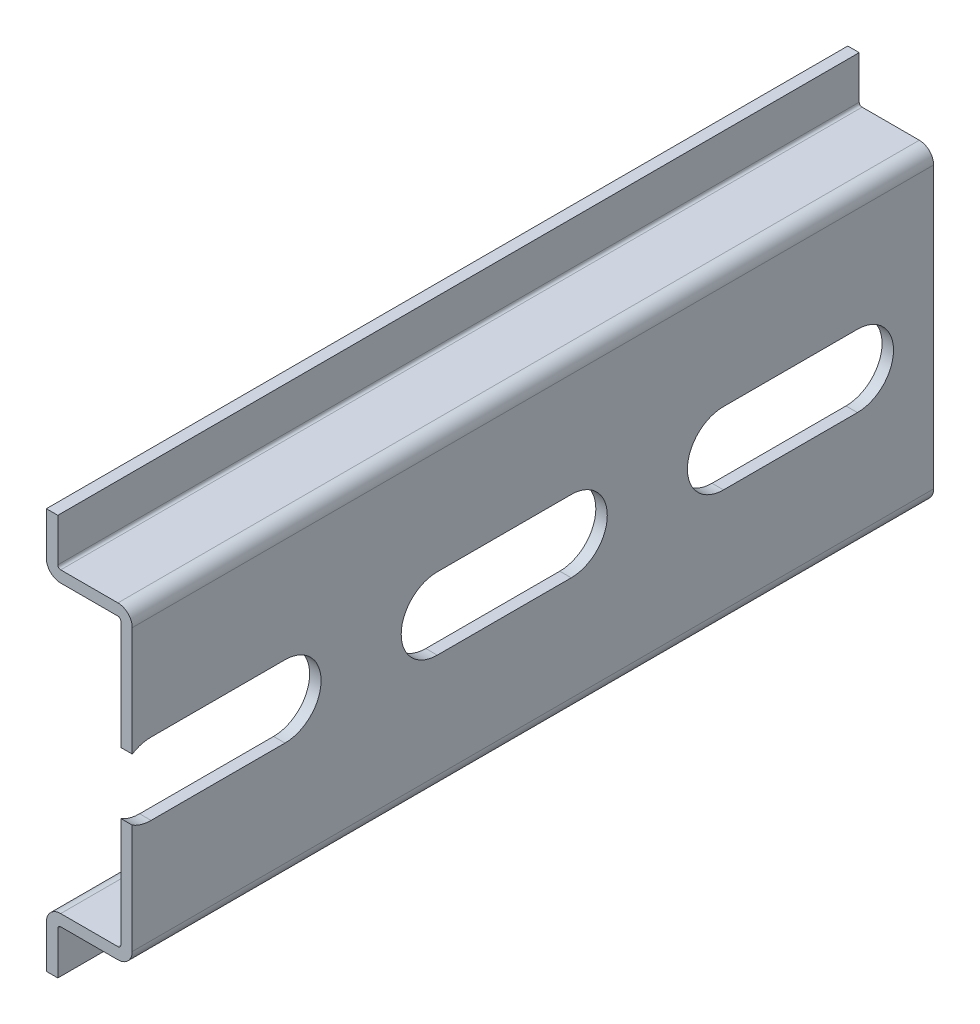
from build123d import *

# Parameters (mm, degrees)
EXTRUDE_THIN1_DEPTH      = 50.00625
EXTRUDE_THIN1_DEPTH_BACK = 50.00625
CUT_EXTRUDE1_DEPTH       = 54.50817731
CUT_EXTRUDE1_DEPTH_BACK  = 54.50817731
FILLET1_R                = 0.25
FILLET2_R                = 1.25
CUT_EXTRUDE2_DEPTH       = 54.50817731
CUT_EXTRUDE2_DEPTH_BACK  = 54.50817731
SKETCH6_W                = 30.0125
SKETCH6_H                = 35


with BuildPart() as part:
    # Sketch3 → Extrude-Thin1 (new, two sides: drawn at the far end of the back side and taken through both)
    with BuildSketch(Plane.XY.offset(-EXTRUDE_THIN1_DEPTH_BACK)):
        Polygon((-6.5, 17.5), (-6.5, 13.5), (0, 13.5), (0, -13.5), (-6.5, -13.5), (-6.5, -17.5), (-7.5, -17.5), (-7.5, -12.5), (-1, -12.5), (-1, 12.5), (-7.5, 12.5), (-7.5, 17.5), align=None)
    extrude(amount=EXTRUDE_THIN1_DEPTH + EXTRUDE_THIN1_DEPTH_BACK)

    # Sketch4 → Cut-Extrude1 (cut, two sides: drawn at the far end of the back side and taken through both)
    with BuildSketch(Plane(origin=(0, 0, 0), x_dir=(0, 0, -1), z_dir=(1, 0, 0)).offset(-CUT_EXTRUDE1_DEPTH_BACK)):
        with BuildLine():
            Line((6.65, 3.15), (18.35, 3.15))
            ThreePointArc((18.35, 3.15), (21.5, 0), (18.35, -3.15))
            Line((18.35, -3.15), (6.65, -3.15))
            ThreePointArc((6.65, -3.15), (3.5, 0), (6.65, 3.15))
        make_face()
        with BuildLine():
            Line((31.65, -3.15), (43.35, -3.15))
            ThreePointArc((43.35, -3.15), (46.5, 0), (43.35, 3.15))
            Line((43.35, 3.15), (31.65, 3.15))
            ThreePointArc((31.65, 3.15), (28.5, 0), (31.65, -3.15))
        make_face()
        with BuildLine():
            Line((56.65, -3.15), (68.35, -3.15))
            ThreePointArc((68.35, -3.15), (71.5, 0), (68.35, 3.15))
            Line((68.35, 3.15), (56.65, 3.15))
            ThreePointArc((56.65, 3.15), (53.5, 0), (56.65, -3.15))
        make_face()
        with BuildLine():
            Line((-18.35, -3.15), (-6.65, -3.15))
            ThreePointArc((-6.65, -3.15), (-3.5, 0), (-6.65, 3.15))
            Line((-6.65, 3.15), (-18.35, 3.15))
            ThreePointArc((-18.35, 3.15), (-21.5, 0), (-18.35, -3.15))
        make_face()
        with BuildLine():
            Line((-43.35, -3.15), (-31.65, -3.15))
            ThreePointArc((-31.65, -3.15), (-28.5, 0), (-31.65, 3.15))
            Line((-31.65, 3.15), (-43.35, 3.15))
            ThreePointArc((-43.35, 3.15), (-46.5, 0), (-43.35, -3.15))
        make_face()
        with BuildLine():
            Line((-68.35, -3.15), (-56.65, -3.15))
            ThreePointArc((-56.65, -3.15), (-53.5, 0), (-56.65, 3.15))
            Line((-56.65, 3.15), (-68.35, 3.15))
            ThreePointArc((-68.35, 3.15), (-71.5, 0), (-68.35, -3.15))
        make_face()
    extrude(amount=CUT_EXTRUDE1_DEPTH + CUT_EXTRUDE1_DEPTH_BACK, mode=Mode.SUBTRACT)

    # Fillet1
    fillet1_edges = [part.edges().sort_by_distance(p)[0] for p in [
        (-6.5, 13.5, 0),
        (-6.5, -13.5, 0),
        (-1, -12.5, 0),
        (-1, 12.5, 0),
    ]]
    fillet(fillet1_edges, radius=FILLET1_R)

    # Fillet2
    fillet2_edges = [part.edges().sort_by_distance(p)[0] for p in [
        (0, 13.5, 0),
        (0, -13.5, 0),
        (-7.5, -12.5, 0),
        (-7.5, 12.5, 0),
    ]]
    fillet(fillet2_edges, radius=FILLET2_R)

    # Sketch6 → Cut-Extrude2 (cut, two sides: drawn at the far end of the back side and taken through both)
    with BuildSketch(Plane(origin=(0, 0, 0), x_dir=(0, 0, -1), z_dir=(1, 0, 0)).offset(-CUT_EXTRUDE2_DEPTH_BACK)):
        with Locations((-35, 0)):
            Rectangle(SKETCH6_W, SKETCH6_H)
    extrude(amount=CUT_EXTRUDE2_DEPTH + CUT_EXTRUDE2_DEPTH_BACK, mode=Mode.SUBTRACT)


solid = part.part
